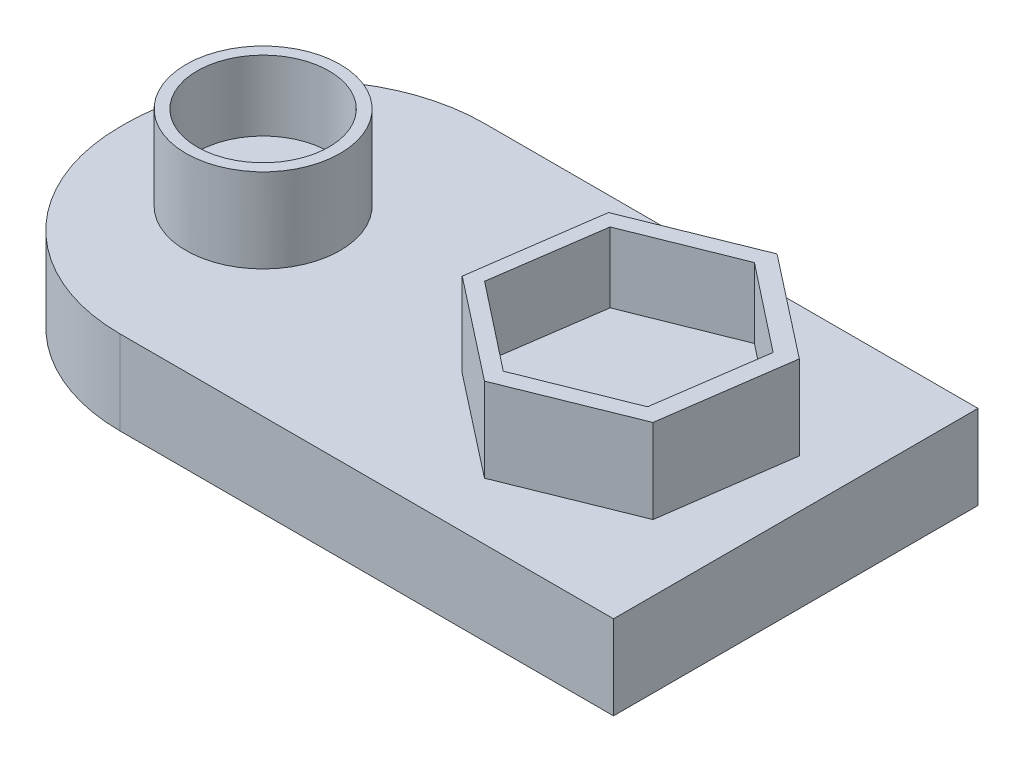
ISO-10303-21;
HEADER;
FILE_DESCRIPTION(('STEP AP214'),'2;1');
FILE_NAME('part.step','',(''),(''),'','','');
FILE_SCHEMA(('AUTOMOTIVE_DESIGN { 1 0 10303 214 1 1 1 1 }'));
ENDSEC;
DATA;
#1=APPLICATION_CONTEXT('core data for automotive mechanical design processes');
#2=APPLICATION_PROTOCOL_DEFINITION('international standard','automotive_design',2000,#1);
#3=PRODUCT_CONTEXT('',#1,'mechanical');
#4=PRODUCT('Part','Part','',(#3));
#5=PRODUCT_RELATED_PRODUCT_CATEGORY('part','',(#4));
#6=PRODUCT_DEFINITION_FORMATION('','',#4);
#7=PRODUCT_DEFINITION_CONTEXT('part definition',#1,'design');
#8=PRODUCT_DEFINITION('design','',#6,#7);
#9=PRODUCT_DEFINITION_SHAPE('','',#8);
#10=(LENGTH_UNIT() NAMED_UNIT(*) SI_UNIT(.MILLI.,.METRE.));
#11=(NAMED_UNIT(*) PLANE_ANGLE_UNIT() SI_UNIT($,.RADIAN.));
#12=(NAMED_UNIT(*) SI_UNIT($,.STERADIAN.) SOLID_ANGLE_UNIT());
#13=UNCERTAINTY_MEASURE_WITH_UNIT(LENGTH_MEASURE(1.E-05),#10,'distance_accuracy_value','');
#14=(GEOMETRIC_REPRESENTATION_CONTEXT(3) GLOBAL_UNCERTAINTY_ASSIGNED_CONTEXT((#13)) GLOBAL_UNIT_ASSIGNED_CONTEXT((#10,
#11,#12)) REPRESENTATION_CONTEXT('',''));
#15=CARTESIAN_POINT('',(0.,0.,0.));
#16=DIRECTION('',(0.,0.,1.));
#17=DIRECTION('',(1.,0.,0.));
#18=AXIS2_PLACEMENT_3D('',#15,#16,#17);
#19=CARTESIAN_POINT('',(6.4,3.,6.6));
#20=DIRECTION('',(0.,-1.,0.));
#21=DIRECTION('',(0.,0.,-1.));
#22=AXIS2_PLACEMENT_3D('',#19,#20,#21);
#23=PLANE('',#22);
#24=CARTESIAN_POINT('',(5.,3.,6.5));
#25=DIRECTION('',(0.,-1.,0.));
#26=DIRECTION('',(0.,0.,-1.));
#27=AXIS2_PLACEMENT_3D('',#24,#25,#26);
#28=CIRCLE('',#27,2.75);
#29=CARTESIAN_POINT('',(5.,3.,3.75));
#30=VERTEX_POINT('',#29);
#31=EDGE_CURVE('E11',#30,#30,#28,.F.);
#32=ORIENTED_EDGE('',*,*,#31,.F.);
#33=EDGE_LOOP('',(#32));
#34=FACE_BOUND('',#33,.T.);
#35=DIRECTION('',(0.,0.,-1.));
#36=VECTOR('',#35,1.);
#37=CARTESIAN_POINT('',(24.,3.,0.));
#38=LINE('',#37,#36);
#39=CARTESIAN_POINT('',(24.,3.,13.));
#40=VERTEX_POINT('',#39);
#41=CARTESIAN_POINT('',(24.,3.,0.));
#42=VERTEX_POINT('',#41);
#43=EDGE_CURVE('E287',#40,#42,#38,.T.);
#44=ORIENTED_EDGE('',*,*,#43,.T.);
#45=DIRECTION('',(-1.,0.,0.));
#46=VECTOR('',#45,1.);
#47=CARTESIAN_POINT('',(6.4,3.,0.));
#48=LINE('',#47,#46);
#49=CARTESIAN_POINT('',(6.4,3.,0.));
#50=VERTEX_POINT('',#49);
#51=EDGE_CURVE('E290',#42,#50,#48,.T.);
#52=ORIENTED_EDGE('',*,*,#51,.T.);
#53=CARTESIAN_POINT('',(6.4,3.,6.4));
#54=DIRECTION('',(0.,1.,0.));
#55=DIRECTION('',(0.,0.,-1.));
#56=AXIS2_PLACEMENT_3D('',#53,#54,#55);
#57=CIRCLE('',#56,6.4);
#58=CARTESIAN_POINT('',(0.,3.,6.4));
#59=VERTEX_POINT('',#58);
#60=EDGE_CURVE('E292',#50,#59,#57,.T.);
#61=ORIENTED_EDGE('',*,*,#60,.T.);
#62=DIRECTION('',(0.,0.,1.));
#63=VECTOR('',#62,1.);
#64=CARTESIAN_POINT('',(0.,3.,6.4));
#65=LINE('',#64,#63);
#66=CARTESIAN_POINT('',(0.,3.,6.59999999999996));
#67=VERTEX_POINT('',#66);
#68=EDGE_CURVE('E294',#59,#67,#65,.T.);
#69=ORIENTED_EDGE('',*,*,#68,.T.);
#70=CARTESIAN_POINT('',(6.4,3.,6.6));
#71=DIRECTION('',(0.,1.,0.));
#72=DIRECTION('',(0.,0.,-1.));
#73=AXIS2_PLACEMENT_3D('',#70,#71,#72);
#74=CIRCLE('',#73,6.4);
#75=CARTESIAN_POINT('',(6.40000000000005,3.,13.));
#76=VERTEX_POINT('',#75);
#77=EDGE_CURVE('E296',#67,#76,#74,.T.);
#78=ORIENTED_EDGE('',*,*,#77,.T.);
#79=DIRECTION('',(1.,0.,0.));
#80=VECTOR('',#79,1.);
#81=CARTESIAN_POINT('',(6.40000000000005,3.,13.));
#82=LINE('',#81,#80);
#83=EDGE_CURVE('E298',#76,#40,#82,.T.);
#84=ORIENTED_EDGE('',*,*,#83,.T.);
#85=EDGE_LOOP('',(#44,#52,#61,#69,#78,#84));
#86=FACE_BOUND('',#85,.T.);
#87=DIRECTION('',(0.927343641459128,0.,-0.374210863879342));
#88=VECTOR('',#87,1.);
#89=CARTESIAN_POINT('',(17.3552350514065,3.,10.9591383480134));
#90=LINE('',#89,#88);
#91=CARTESIAN_POINT('',(17.3552350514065,3.,10.9591383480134));
#92=VERTEX_POINT('',#91);
#93=CARTESIAN_POINT('',(21.6384518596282,3.,9.23073240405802));
#94=VERTEX_POINT('',#93);
#95=EDGE_CURVE('E225',#92,#94,#90,.T.);
#96=ORIENTED_EDGE('',*,*,#95,.F.);
#97=DIRECTION('',(0.787747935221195,0.,0.615997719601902));
#98=VECTOR('',#97,1.);
#99=CARTESIAN_POINT('',(13.7167831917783,3.,8.11396675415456));
#100=LINE('',#99,#98);
#101=CARTESIAN_POINT('',(13.7167831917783,3.,8.11396675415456));
#102=VERTEX_POINT('',#101);
#103=EDGE_CURVE('E238',#102,#92,#100,.T.);
#104=ORIENTED_EDGE('',*,*,#103,.F.);
#105=DIRECTION('',(-0.139595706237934,0.,0.990208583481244));
#106=VECTOR('',#105,1.);
#107=CARTESIAN_POINT('',(14.3615481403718,3.,3.54038921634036));
#108=LINE('',#107,#106);
#109=CARTESIAN_POINT('',(14.3615481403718,3.,3.54038921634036));
#110=VERTEX_POINT('',#109);
#111=EDGE_CURVE('E235',#110,#102,#108,.T.);
#112=ORIENTED_EDGE('',*,*,#111,.F.);
#113=DIRECTION('',(-0.927343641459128,0.,0.374210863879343));
#114=VECTOR('',#113,1.);
#115=CARTESIAN_POINT('',(18.6447649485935,3.,1.811983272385));
#116=LINE('',#115,#114);
#117=CARTESIAN_POINT('',(18.6447649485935,3.,1.811983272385));
#118=VERTEX_POINT('',#117);
#119=EDGE_CURVE('E232',#118,#110,#116,.T.);
#120=ORIENTED_EDGE('',*,*,#119,.F.);
#121=DIRECTION('',(-0.787747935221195,0.,-0.615997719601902));
#122=VECTOR('',#121,1.);
#123=CARTESIAN_POINT('',(22.2832168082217,3.,4.65715486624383));
#124=LINE('',#123,#122);
#125=CARTESIAN_POINT('',(22.2832168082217,3.,4.65715486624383));
#126=VERTEX_POINT('',#125);
#127=EDGE_CURVE('E229',#126,#118,#124,.T.);
#128=ORIENTED_EDGE('',*,*,#127,.F.);
#129=DIRECTION('',(0.139595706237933,0.,-0.990208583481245));
#130=VECTOR('',#129,1.);
#131=CARTESIAN_POINT('',(21.6384518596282,3.,9.23073240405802));
#132=LINE('',#131,#130);
#133=EDGE_CURVE('E60',#94,#126,#132,.T.);
#134=ORIENTED_EDGE('',*,*,#133,.F.);
#135=EDGE_LOOP('',(#96,#104,#112,#120,#128,#134));
#136=FACE_BOUND('',#135,.T.);
#137=ADVANCED_FACE('F37',(#34,#86,#136),#23,.F.);
#138=CARTESIAN_POINT('',(24.,3.,0.));
#139=DIRECTION('',(-1.,0.,0.));
#140=DIRECTION('',(0.,0.,1.));
#141=AXIS2_PLACEMENT_3D('',#138,#139,#140);
#142=PLANE('',#141);
#143=DIRECTION('',(0.,0.,-1.));
#144=VECTOR('',#143,1.);
#145=CARTESIAN_POINT('',(24.,0.,0.));
#146=LINE('',#145,#144);
#147=CARTESIAN_POINT('',(24.,0.,13.));
#148=VERTEX_POINT('',#147);
#149=CARTESIAN_POINT('',(24.,0.,0.));
#150=VERTEX_POINT('',#149);
#151=EDGE_CURVE('E274',#148,#150,#146,.T.);
#152=ORIENTED_EDGE('',*,*,#151,.T.);
#153=DIRECTION('',(0.,-1.,0.));
#154=VECTOR('',#153,1.);
#155=CARTESIAN_POINT('',(24.,3.,0.));
#156=LINE('',#155,#154);
#157=EDGE_CURVE('E45',#42,#150,#156,.T.);
#158=ORIENTED_EDGE('',*,*,#157,.F.);
#159=ORIENTED_EDGE('',*,*,#43,.F.);
#160=DIRECTION('',(0.,-1.,0.));
#161=VECTOR('',#160,1.);
#162=CARTESIAN_POINT('',(24.,3.,13.));
#163=LINE('',#162,#161);
#164=EDGE_CURVE('E300',#40,#148,#163,.T.);
#165=ORIENTED_EDGE('',*,*,#164,.T.);
#166=EDGE_LOOP('',(#152,#158,#159,#165));
#167=FACE_BOUND('',#166,.T.);
#168=ADVANCED_FACE('F39',(#167),#142,.F.);
#169=CARTESIAN_POINT('',(6.4,3.,0.));
#170=DIRECTION('',(0.,0.,1.));
#171=DIRECTION('',(1.,0.,0.));
#172=AXIS2_PLACEMENT_3D('',#169,#170,#171);
#173=PLANE('',#172);
#174=DIRECTION('',(-1.,0.,0.));
#175=VECTOR('',#174,1.);
#176=CARTESIAN_POINT('',(6.4,0.,0.));
#177=LINE('',#176,#175);
#178=CARTESIAN_POINT('',(6.4,0.,0.));
#179=VERTEX_POINT('',#178);
#180=EDGE_CURVE('E277',#150,#179,#177,.T.);
#181=ORIENTED_EDGE('',*,*,#180,.T.);
#182=DIRECTION('',(0.,-1.,0.));
#183=VECTOR('',#182,1.);
#184=CARTESIAN_POINT('',(6.4,3.,0.));
#185=LINE('',#184,#183);
#186=EDGE_CURVE('E312',#50,#179,#185,.T.);
#187=ORIENTED_EDGE('',*,*,#186,.F.);
#188=ORIENTED_EDGE('',*,*,#51,.F.);
#189=ORIENTED_EDGE('',*,*,#157,.T.);
#190=EDGE_LOOP('',(#181,#187,#188,#189));
#191=FACE_BOUND('',#190,.T.);
#192=ADVANCED_FACE('F317',(#191),#173,.F.);
#193=CARTESIAN_POINT('',(6.4,3.,6.4));
#194=DIRECTION('',(0.,-1.,0.));
#195=DIRECTION('',(0.,0.,-1.));
#196=AXIS2_PLACEMENT_3D('',#193,#194,#195);
#197=CYLINDRICAL_SURFACE('',#196,6.4);
#198=CARTESIAN_POINT('',(6.4,0.,6.4));
#199=DIRECTION('',(0.,1.,0.));
#200=DIRECTION('',(0.,0.,-1.));
#201=AXIS2_PLACEMENT_3D('',#198,#199,#200);
#202=CIRCLE('',#201,6.4);
#203=CARTESIAN_POINT('',(0.,0.,6.4));
#204=VERTEX_POINT('',#203);
#205=EDGE_CURVE('E279',#179,#204,#202,.T.);
#206=ORIENTED_EDGE('',*,*,#205,.T.);
#207=DIRECTION('',(0.,-1.,0.));
#208=VECTOR('',#207,1.);
#209=CARTESIAN_POINT('',(0.,3.,6.4));
#210=LINE('',#209,#208);
#211=EDGE_CURVE('E309',#59,#204,#210,.T.);
#212=ORIENTED_EDGE('',*,*,#211,.F.);
#213=ORIENTED_EDGE('',*,*,#60,.F.);
#214=ORIENTED_EDGE('',*,*,#186,.T.);
#215=EDGE_LOOP('',(#206,#212,#213,#214));
#216=FACE_BOUND('',#215,.T.);
#217=ADVANCED_FACE('F331',(#216),#197,.T.);
#218=CARTESIAN_POINT('',(0.,3.,6.4));
#219=DIRECTION('',(1.,0.,0.));
#220=DIRECTION('',(0.,0.,-1.));
#221=AXIS2_PLACEMENT_3D('',#218,#219,#220);
#222=PLANE('',#221);
#223=DIRECTION('',(0.,0.,1.));
#224=VECTOR('',#223,1.);
#225=CARTESIAN_POINT('',(0.,0.,6.4));
#226=LINE('',#225,#224);
#227=CARTESIAN_POINT('',(0.,0.,6.59999999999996));
#228=VERTEX_POINT('',#227);
#229=EDGE_CURVE('E281',#204,#228,#226,.T.);
#230=ORIENTED_EDGE('',*,*,#229,.T.);
#231=DIRECTION('',(0.,-1.,0.));
#232=VECTOR('',#231,1.);
#233=CARTESIAN_POINT('',(0.,3.,6.59999999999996));
#234=LINE('',#233,#232);
#235=EDGE_CURVE('E306',#67,#228,#234,.T.);
#236=ORIENTED_EDGE('',*,*,#235,.F.);
#237=ORIENTED_EDGE('',*,*,#68,.F.);
#238=ORIENTED_EDGE('',*,*,#211,.T.);
#239=EDGE_LOOP('',(#230,#236,#237,#238));
#240=FACE_BOUND('',#239,.T.);
#241=ADVANCED_FACE('F335',(#240),#222,.F.);
#242=CARTESIAN_POINT('',(6.4,3.,6.6));
#243=DIRECTION('',(0.,-1.,0.));
#244=DIRECTION('',(0.,0.,-1.));
#245=AXIS2_PLACEMENT_3D('',#242,#243,#244);
#246=CYLINDRICAL_SURFACE('',#245,6.4);
#247=CARTESIAN_POINT('',(6.4,0.,6.6));
#248=DIRECTION('',(0.,1.,0.));
#249=DIRECTION('',(0.,0.,-1.));
#250=AXIS2_PLACEMENT_3D('',#247,#248,#249);
#251=CIRCLE('',#250,6.4);
#252=CARTESIAN_POINT('',(6.40000000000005,0.,13.));
#253=VERTEX_POINT('',#252);
#254=EDGE_CURVE('E283',#228,#253,#251,.T.);
#255=ORIENTED_EDGE('',*,*,#254,.T.);
#256=DIRECTION('',(0.,-1.,0.));
#257=VECTOR('',#256,1.);
#258=CARTESIAN_POINT('',(6.40000000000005,3.,13.));
#259=LINE('',#258,#257);
#260=EDGE_CURVE('E303',#76,#253,#259,.T.);
#261=ORIENTED_EDGE('',*,*,#260,.F.);
#262=ORIENTED_EDGE('',*,*,#77,.F.);
#263=ORIENTED_EDGE('',*,*,#235,.T.);
#264=EDGE_LOOP('',(#255,#261,#262,#263));
#265=FACE_BOUND('',#264,.T.);
#266=ADVANCED_FACE('F344',(#265),#246,.T.);
#267=CARTESIAN_POINT('',(6.40000000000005,3.,13.));
#268=DIRECTION('',(0.,0.,-1.));
#269=DIRECTION('',(-1.,0.,0.));
#270=AXIS2_PLACEMENT_3D('',#267,#268,#269);
#271=PLANE('',#270);
#272=DIRECTION('',(1.,0.,0.));
#273=VECTOR('',#272,1.);
#274=CARTESIAN_POINT('',(6.40000000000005,0.,13.));
#275=LINE('',#274,#273);
#276=EDGE_CURVE('E285',#253,#148,#275,.T.);
#277=ORIENTED_EDGE('',*,*,#276,.T.);
#278=ORIENTED_EDGE('',*,*,#164,.F.);
#279=ORIENTED_EDGE('',*,*,#83,.F.);
#280=ORIENTED_EDGE('',*,*,#260,.T.);
#281=EDGE_LOOP('',(#277,#278,#279,#280));
#282=FACE_BOUND('',#281,.T.);
#283=ADVANCED_FACE('F342',(#282),#271,.F.);
#284=CARTESIAN_POINT('',(6.4,0.,6.6));
#285=DIRECTION('',(0.,-1.,0.));
#286=DIRECTION('',(0.,0.,-1.));
#287=AXIS2_PLACEMENT_3D('',#284,#285,#286);
#288=PLANE('',#287);
#289=ORIENTED_EDGE('',*,*,#151,.F.);
#290=ORIENTED_EDGE('',*,*,#276,.F.);
#291=ORIENTED_EDGE('',*,*,#254,.F.);
#292=ORIENTED_EDGE('',*,*,#229,.F.);
#293=ORIENTED_EDGE('',*,*,#205,.F.);
#294=ORIENTED_EDGE('',*,*,#180,.F.);
#295=EDGE_LOOP('',(#289,#290,#291,#292,#293,#294));
#296=FACE_BOUND('',#295,.T.);
#297=ADVANCED_FACE('F325',(#296),#288,.T.);
#298=CARTESIAN_POINT('',(5.,6.,6.5));
#299=DIRECTION('',(0.,-1.,0.));
#300=DIRECTION('',(0.,0.,-1.));
#301=AXIS2_PLACEMENT_3D('',#298,#299,#300);
#302=CYLINDRICAL_SURFACE('',#301,2.75);
#303=CARTESIAN_POINT('',(5.,6.,6.5));
#304=DIRECTION('',(0.,1.,0.));
#305=DIRECTION('',(0.,0.,1.));
#306=AXIS2_PLACEMENT_3D('',#303,#304,#305);
#307=CIRCLE('',#306,2.75);
#308=CARTESIAN_POINT('',(5.,6.,9.25));
#309=VERTEX_POINT('',#308);
#310=EDGE_CURVE('E271',#309,#309,#307,.T.);
#311=ORIENTED_EDGE('',*,*,#310,.F.);
#312=EDGE_LOOP('',(#311));
#313=FACE_BOUND('',#312,.T.);
#314=ORIENTED_EDGE('',*,*,#31,.T.);
#315=EDGE_LOOP('',(#314));
#316=FACE_BOUND('',#315,.T.);
#317=ADVANCED_FACE('F363',(#313,#316),#302,.T.);
#318=CARTESIAN_POINT('',(5.,6.,6.5));
#319=DIRECTION('',(0.,1.,0.));
#320=DIRECTION('',(0.,0.,1.));
#321=AXIS2_PLACEMENT_3D('',#318,#319,#320);
#322=PLANE('',#321);
#323=CARTESIAN_POINT('',(5.,6.,6.5));
#324=DIRECTION('',(0.,1.,0.));
#325=DIRECTION('',(0.,0.,1.));
#326=AXIS2_PLACEMENT_3D('',#323,#324,#325);
#327=CIRCLE('',#326,2.3523091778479);
#328=CARTESIAN_POINT('',(5.,6.,8.8523091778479));
#329=VERTEX_POINT('',#328);
#330=EDGE_CURVE('E213',#329,#329,#327,.T.);
#331=ORIENTED_EDGE('',*,*,#330,.F.);
#332=EDGE_LOOP('',(#331));
#333=FACE_BOUND('',#332,.T.);
#334=ORIENTED_EDGE('',*,*,#310,.T.);
#335=EDGE_LOOP('',(#334));
#336=FACE_BOUND('',#335,.T.);
#337=ADVANCED_FACE('F366',(#333,#336),#322,.T.);
#338=CARTESIAN_POINT('',(17.3552350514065,6.,10.9591383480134));
#339=DIRECTION('',(-0.374210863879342,0.,-0.927343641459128));
#340=DIRECTION('',(-0.927343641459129,0.,0.374210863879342));
#341=AXIS2_PLACEMENT_3D('',#338,#339,#340);
#342=PLANE('',#341);
#343=ORIENTED_EDGE('',*,*,#95,.T.);
#344=DIRECTION('',(0.,-1.,0.));
#345=VECTOR('',#344,1.);
#346=CARTESIAN_POINT('',(21.6384518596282,6.,9.23073240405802));
#347=LINE('',#346,#345);
#348=CARTESIAN_POINT('',(21.6384518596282,6.,9.23073240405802));
#349=VERTEX_POINT('',#348);
#350=EDGE_CURVE('E269',#349,#94,#347,.T.);
#351=ORIENTED_EDGE('',*,*,#350,.F.);
#352=DIRECTION('',(0.927343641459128,0.,-0.374210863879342));
#353=VECTOR('',#352,1.);
#354=CARTESIAN_POINT('',(17.3552350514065,6.,10.9591383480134));
#355=LINE('',#354,#353);
#356=CARTESIAN_POINT('',(17.3552350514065,6.,10.9591383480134));
#357=VERTEX_POINT('',#356);
#358=EDGE_CURVE('E241',#357,#349,#355,.T.);
#359=ORIENTED_EDGE('',*,*,#358,.F.);
#360=DIRECTION('',(0.,-1.,0.));
#361=VECTOR('',#360,1.);
#362=CARTESIAN_POINT('',(17.3552350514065,6.,10.9591383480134));
#363=LINE('',#362,#361);
#364=EDGE_CURVE('E254',#357,#92,#363,.T.);
#365=ORIENTED_EDGE('',*,*,#364,.T.);
#366=EDGE_LOOP('',(#343,#351,#359,#365));
#367=FACE_BOUND('',#366,.T.);
#368=ADVANCED_FACE('F370',(#367),#342,.F.);
#369=CARTESIAN_POINT('',(21.6384518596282,6.,9.23073240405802));
#370=DIRECTION('',(-0.990208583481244,0.,-0.139595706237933));
#371=DIRECTION('',(-0.139595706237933,0.,0.990208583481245));
#372=AXIS2_PLACEMENT_3D('',#369,#370,#371);
#373=PLANE('',#372);
#374=ORIENTED_EDGE('',*,*,#133,.T.);
#375=DIRECTION('',(0.,-1.,0.));
#376=VECTOR('',#375,1.);
#377=CARTESIAN_POINT('',(22.2832168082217,6.,4.65715486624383));
#378=LINE('',#377,#376);
#379=CARTESIAN_POINT('',(22.2832168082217,6.,4.65715486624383));
#380=VERTEX_POINT('',#379);
#381=EDGE_CURVE('E266',#380,#126,#378,.T.);
#382=ORIENTED_EDGE('',*,*,#381,.F.);
#383=DIRECTION('',(0.139595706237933,0.,-0.990208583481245));
#384=VECTOR('',#383,1.);
#385=CARTESIAN_POINT('',(21.6384518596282,6.,9.23073240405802));
#386=LINE('',#385,#384);
#387=EDGE_CURVE('E244',#349,#380,#386,.T.);
#388=ORIENTED_EDGE('',*,*,#387,.F.);
#389=ORIENTED_EDGE('',*,*,#350,.T.);
#390=EDGE_LOOP('',(#374,#382,#388,#389));
#391=FACE_BOUND('',#390,.T.);
#392=ADVANCED_FACE('F374',(#391),#373,.F.);
#393=CARTESIAN_POINT('',(22.2832168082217,6.,4.65715486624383));
#394=DIRECTION('',(-0.615997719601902,0.,0.787747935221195));
#395=DIRECTION('',(0.787747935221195,0.,0.615997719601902));
#396=AXIS2_PLACEMENT_3D('',#393,#394,#395);
#397=PLANE('',#396);
#398=ORIENTED_EDGE('',*,*,#127,.T.);
#399=DIRECTION('',(0.,-1.,0.));
#400=VECTOR('',#399,1.);
#401=CARTESIAN_POINT('',(18.6447649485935,6.,1.811983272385));
#402=LINE('',#401,#400);
#403=CARTESIAN_POINT('',(18.6447649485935,6.,1.811983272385));
#404=VERTEX_POINT('',#403);
#405=EDGE_CURVE('E263',#404,#118,#402,.T.);
#406=ORIENTED_EDGE('',*,*,#405,.F.);
#407=DIRECTION('',(-0.787747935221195,0.,-0.615997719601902));
#408=VECTOR('',#407,1.);
#409=CARTESIAN_POINT('',(22.2832168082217,6.,4.65715486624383));
#410=LINE('',#409,#408);
#411=EDGE_CURVE('E246',#380,#404,#410,.T.);
#412=ORIENTED_EDGE('',*,*,#411,.F.);
#413=ORIENTED_EDGE('',*,*,#381,.T.);
#414=EDGE_LOOP('',(#398,#406,#412,#413));
#415=FACE_BOUND('',#414,.T.);
#416=ADVANCED_FACE('F378',(#415),#397,.F.);
#417=CARTESIAN_POINT('',(18.6447649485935,6.,1.811983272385));
#418=DIRECTION('',(0.374210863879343,0.,0.927343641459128));
#419=DIRECTION('',(0.927343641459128,0.,-0.374210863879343));
#420=AXIS2_PLACEMENT_3D('',#417,#418,#419);
#421=PLANE('',#420);
#422=ORIENTED_EDGE('',*,*,#119,.T.);
#423=DIRECTION('',(0.,-1.,0.));
#424=VECTOR('',#423,1.);
#425=CARTESIAN_POINT('',(14.3615481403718,6.,3.54038921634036));
#426=LINE('',#425,#424);
#427=CARTESIAN_POINT('',(14.3615481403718,6.,3.54038921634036));
#428=VERTEX_POINT('',#427);
#429=EDGE_CURVE('E260',#428,#110,#426,.T.);
#430=ORIENTED_EDGE('',*,*,#429,.F.);
#431=DIRECTION('',(-0.927343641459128,0.,0.374210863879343));
#432=VECTOR('',#431,1.);
#433=CARTESIAN_POINT('',(18.6447649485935,6.,1.811983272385));
#434=LINE('',#433,#432);
#435=EDGE_CURVE('E248',#404,#428,#434,.T.);
#436=ORIENTED_EDGE('',*,*,#435,.F.);
#437=ORIENTED_EDGE('',*,*,#405,.T.);
#438=EDGE_LOOP('',(#422,#430,#436,#437));
#439=FACE_BOUND('',#438,.T.);
#440=ADVANCED_FACE('F382',(#439),#421,.F.);
#441=CARTESIAN_POINT('',(14.3615481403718,6.,3.54038921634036));
#442=DIRECTION('',(0.990208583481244,0.,0.139595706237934));
#443=DIRECTION('',(0.139595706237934,0.,-0.990208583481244));
#444=AXIS2_PLACEMENT_3D('',#441,#442,#443);
#445=PLANE('',#444);
#446=ORIENTED_EDGE('',*,*,#111,.T.);
#447=DIRECTION('',(0.,-1.,0.));
#448=VECTOR('',#447,1.);
#449=CARTESIAN_POINT('',(13.7167831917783,6.,8.11396675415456));
#450=LINE('',#449,#448);
#451=CARTESIAN_POINT('',(13.7167831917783,6.,8.11396675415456));
#452=VERTEX_POINT('',#451);
#453=EDGE_CURVE('E257',#452,#102,#450,.T.);
#454=ORIENTED_EDGE('',*,*,#453,.F.);
#455=DIRECTION('',(-0.139595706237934,0.,0.990208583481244));
#456=VECTOR('',#455,1.);
#457=CARTESIAN_POINT('',(14.3615481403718,6.,3.54038921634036));
#458=LINE('',#457,#456);
#459=EDGE_CURVE('E250',#428,#452,#458,.T.);
#460=ORIENTED_EDGE('',*,*,#459,.F.);
#461=ORIENTED_EDGE('',*,*,#429,.T.);
#462=EDGE_LOOP('',(#446,#454,#460,#461));
#463=FACE_BOUND('',#462,.T.);
#464=ADVANCED_FACE('F386',(#463),#445,.F.);
#465=CARTESIAN_POINT('',(13.7167831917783,6.,8.11396675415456));
#466=DIRECTION('',(0.615997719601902,0.,-0.787747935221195));
#467=DIRECTION('',(-0.787747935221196,0.,-0.615997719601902));
#468=AXIS2_PLACEMENT_3D('',#465,#466,#467);
#469=PLANE('',#468);
#470=ORIENTED_EDGE('',*,*,#103,.T.);
#471=ORIENTED_EDGE('',*,*,#364,.F.);
#472=DIRECTION('',(0.787747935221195,0.,0.615997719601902));
#473=VECTOR('',#472,1.);
#474=CARTESIAN_POINT('',(13.7167831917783,6.,8.11396675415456));
#475=LINE('',#474,#473);
#476=EDGE_CURVE('E252',#452,#357,#475,.T.);
#477=ORIENTED_EDGE('',*,*,#476,.F.);
#478=ORIENTED_EDGE('',*,*,#453,.T.);
#479=EDGE_LOOP('',(#470,#471,#477,#478));
#480=FACE_BOUND('',#479,.T.);
#481=ADVANCED_FACE('F390',(#480),#469,.F.);
#482=CARTESIAN_POINT('',(21.6384518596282,6.,9.23073240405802));
#483=DIRECTION('',(0.,1.,0.));
#484=DIRECTION('',(0.,0.,1.));
#485=AXIS2_PLACEMENT_3D('',#482,#483,#484);
#486=PLANE('',#485);
#487=DIRECTION('',(0.92821620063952,0.,-0.372041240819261));
#488=VECTOR('',#487,1.);
#489=CARTESIAN_POINT('',(17.3843760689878,6.,10.3169348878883));
#490=LINE('',#489,#488);
#491=CARTESIAN_POINT('',(17.3843760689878,6.,10.3169348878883));
#492=VERTEX_POINT('',#491);
#493=CARTESIAN_POINT('',(21.0573106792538,6.,8.84477446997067));
#494=VERTEX_POINT('',#493);
#495=EDGE_CURVE('E52',#492,#494,#490,.T.);
#496=ORIENTED_EDGE('',*,*,#495,.F.);
#497=DIRECTION('',(0.786305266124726,0.,0.617838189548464));
#498=VECTOR('',#497,1.);
#499=CARTESIAN_POINT('',(14.2729804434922,6.,7.87216041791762));
#500=LINE('',#499,#498);
#501=CARTESIAN_POINT('',(14.2729804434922,6.,7.87216041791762));
#502=VERTEX_POINT('',#501);
#503=EDGE_CURVE('E193',#502,#492,#500,.T.);
#504=ORIENTED_EDGE('',*,*,#503,.F.);
#505=DIRECTION('',(-0.141910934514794,0.,0.989879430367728));
#506=VECTOR('',#505,1.);
#507=CARTESIAN_POINT('',(14.8345194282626,6.,3.95522553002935));
#508=LINE('',#507,#506);
#509=CARTESIAN_POINT('',(14.8345194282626,6.,3.95522553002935));
#510=VERTEX_POINT('',#509);
#511=EDGE_CURVE('E187',#510,#502,#508,.T.);
#512=ORIENTED_EDGE('',*,*,#511,.F.);
#513=DIRECTION('',(-0.92821620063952,0.,0.37204124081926));
#514=VECTOR('',#513,1.);
#515=CARTESIAN_POINT('',(18.5074540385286,6.,2.48306511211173));
#516=LINE('',#515,#514);
#517=CARTESIAN_POINT('',(18.5074540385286,6.,2.48306511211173));
#518=VERTEX_POINT('',#517);
#519=EDGE_CURVE('E185',#518,#510,#516,.T.);
#520=ORIENTED_EDGE('',*,*,#519,.F.);
#521=DIRECTION('',(-0.786305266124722,0.,-0.617838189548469));
#522=VECTOR('',#521,1.);
#523=CARTESIAN_POINT('',(21.6188496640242,6.,4.9278395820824));
#524=LINE('',#523,#522);
#525=CARTESIAN_POINT('',(21.6188496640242,6.,4.9278395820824));
#526=VERTEX_POINT('',#525);
#527=EDGE_CURVE('E166',#526,#518,#524,.T.);
#528=ORIENTED_EDGE('',*,*,#527,.F.);
#529=DIRECTION('',(0.141910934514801,0.,-0.989879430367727));
#530=VECTOR('',#529,1.);
#531=CARTESIAN_POINT('',(21.0573106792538,6.,8.84477446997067));
#532=LINE('',#531,#530);
#533=EDGE_CURVE('E177',#494,#526,#532,.T.);
#534=ORIENTED_EDGE('',*,*,#533,.F.);
#535=EDGE_LOOP('',(#496,#504,#512,#520,#528,#534));
#536=FACE_BOUND('',#535,.T.);
#537=ORIENTED_EDGE('',*,*,#358,.T.);
#538=ORIENTED_EDGE('',*,*,#387,.T.);
#539=ORIENTED_EDGE('',*,*,#411,.T.);
#540=ORIENTED_EDGE('',*,*,#435,.T.);
#541=ORIENTED_EDGE('',*,*,#459,.T.);
#542=ORIENTED_EDGE('',*,*,#476,.T.);
#543=EDGE_LOOP('',(#537,#538,#539,#540,#541,#542));
#544=FACE_BOUND('',#543,.T.);
#545=ADVANCED_FACE('F181',(#536,#544),#486,.T.);
#546=CARTESIAN_POINT('',(5.,3.5,6.5));
#547=DIRECTION('',(0.,1.,0.));
#548=DIRECTION('',(0.,0.,1.));
#549=AXIS2_PLACEMENT_3D('',#546,#547,#548);
#550=CYLINDRICAL_SURFACE('',#549,2.3523091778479);
#551=CARTESIAN_POINT('',(5.,3.5,6.5));
#552=DIRECTION('',(0.,1.,0.));
#553=DIRECTION('',(0.,0.,1.));
#554=AXIS2_PLACEMENT_3D('',#551,#552,#553);
#555=CIRCLE('',#554,2.3523091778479);
#556=CARTESIAN_POINT('',(5.,3.5,8.8523091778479));
#557=VERTEX_POINT('',#556);
#558=EDGE_CURVE('E222',#557,#557,#555,.T.);
#559=ORIENTED_EDGE('',*,*,#558,.F.);
#560=EDGE_LOOP('',(#559));
#561=FACE_BOUND('',#560,.T.);
#562=ORIENTED_EDGE('',*,*,#330,.T.);
#563=EDGE_LOOP('',(#562));
#564=FACE_BOUND('',#563,.T.);
#565=ADVANCED_FACE('F397',(#561,#564),#550,.F.);
#566=CARTESIAN_POINT('',(5.,3.5,6.5));
#567=DIRECTION('',(0.,1.,0.));
#568=DIRECTION('',(0.,0.,1.));
#569=AXIS2_PLACEMENT_3D('',#566,#567,#568);
#570=PLANE('',#569);
#571=ORIENTED_EDGE('',*,*,#558,.T.);
#572=EDGE_LOOP('',(#571));
#573=FACE_BOUND('',#572,.T.);
#574=ADVANCED_FACE('F400',(#573),#570,.T.);
#575=CARTESIAN_POINT('',(17.3843760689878,3.5,10.3169348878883));
#576=DIRECTION('',(0.372041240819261,0.,0.92821620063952));
#577=DIRECTION('',(0.92821620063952,0.,-0.372041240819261));
#578=AXIS2_PLACEMENT_3D('',#575,#576,#577);
#579=PLANE('',#578);
#580=ORIENTED_EDGE('',*,*,#495,.T.);
#581=DIRECTION('',(0.,1.,0.));
#582=VECTOR('',#581,1.);
#583=CARTESIAN_POINT('',(21.0573106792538,3.5,8.84477446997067));
#584=LINE('',#583,#582);
#585=CARTESIAN_POINT('',(21.0573106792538,3.5,8.84477446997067));
#586=VERTEX_POINT('',#585);
#587=EDGE_CURVE('E174',#586,#494,#584,.T.);
#588=ORIENTED_EDGE('',*,*,#587,.F.);
#589=DIRECTION('',(0.92821620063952,0.,-0.372041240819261));
#590=VECTOR('',#589,1.);
#591=CARTESIAN_POINT('',(17.3843760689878,3.5,10.3169348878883));
#592=LINE('',#591,#590);
#593=CARTESIAN_POINT('',(17.3843760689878,3.5,10.3169348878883));
#594=VERTEX_POINT('',#593);
#595=EDGE_CURVE('E196',#594,#586,#592,.T.);
#596=ORIENTED_EDGE('',*,*,#595,.F.);
#597=DIRECTION('',(0.,1.,0.));
#598=VECTOR('',#597,1.);
#599=CARTESIAN_POINT('',(17.3843760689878,3.5,10.3169348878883));
#600=LINE('',#599,#598);
#601=EDGE_CURVE('E211',#594,#492,#600,.T.);
#602=ORIENTED_EDGE('',*,*,#601,.T.);
#603=EDGE_LOOP('',(#580,#588,#596,#602));
#604=FACE_BOUND('',#603,.T.);
#605=ADVANCED_FACE('F404',(#604),#579,.F.);
#606=CARTESIAN_POINT('',(14.2729804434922,3.5,7.87216041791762));
#607=DIRECTION('',(-0.617838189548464,0.,0.786305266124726));
#608=DIRECTION('',(0.786305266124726,0.,0.617838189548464));
#609=AXIS2_PLACEMENT_3D('',#606,#607,#608);
#610=PLANE('',#609);
#611=ORIENTED_EDGE('',*,*,#503,.T.);
#612=ORIENTED_EDGE('',*,*,#601,.F.);
#613=DIRECTION('',(0.786305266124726,0.,0.617838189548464));
#614=VECTOR('',#613,1.);
#615=CARTESIAN_POINT('',(14.2729804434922,3.5,7.87216041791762));
#616=LINE('',#615,#614);
#617=CARTESIAN_POINT('',(14.2729804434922,3.5,7.87216041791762));
#618=VERTEX_POINT('',#617);
#619=EDGE_CURVE('E208',#618,#594,#616,.T.);
#620=ORIENTED_EDGE('',*,*,#619,.F.);
#621=DIRECTION('',(0.,1.,0.));
#622=VECTOR('',#621,1.);
#623=CARTESIAN_POINT('',(14.2729804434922,3.5,7.87216041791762));
#624=LINE('',#623,#622);
#625=EDGE_CURVE('E214',#618,#502,#624,.T.);
#626=ORIENTED_EDGE('',*,*,#625,.T.);
#627=EDGE_LOOP('',(#611,#612,#620,#626));
#628=FACE_BOUND('',#627,.T.);
#629=ADVANCED_FACE('F408',(#628),#610,.F.);
#630=CARTESIAN_POINT('',(14.8345194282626,3.5,3.95522553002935));
#631=DIRECTION('',(-0.989879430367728,0.,-0.141910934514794));
#632=DIRECTION('',(-0.141910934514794,0.,0.989879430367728));
#633=AXIS2_PLACEMENT_3D('',#630,#631,#632);
#634=PLANE('',#633);
#635=ORIENTED_EDGE('',*,*,#511,.T.);
#636=ORIENTED_EDGE('',*,*,#625,.F.);
#637=DIRECTION('',(-0.141910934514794,0.,0.989879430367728));
#638=VECTOR('',#637,1.);
#639=CARTESIAN_POINT('',(14.8345194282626,3.5,3.95522553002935));
#640=LINE('',#639,#638);
#641=CARTESIAN_POINT('',(14.8345194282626,3.5,3.95522553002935));
#642=VERTEX_POINT('',#641);
#643=EDGE_CURVE('E205',#642,#618,#640,.T.);
#644=ORIENTED_EDGE('',*,*,#643,.F.);
#645=DIRECTION('',(0.,1.,0.));
#646=VECTOR('',#645,1.);
#647=CARTESIAN_POINT('',(14.8345194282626,3.5,3.95522553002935));
#648=LINE('',#647,#646);
#649=EDGE_CURVE('E216',#642,#510,#648,.T.);
#650=ORIENTED_EDGE('',*,*,#649,.T.);
#651=EDGE_LOOP('',(#635,#636,#644,#650));
#652=FACE_BOUND('',#651,.T.);
#653=ADVANCED_FACE('F417',(#652),#634,.F.);
#654=CARTESIAN_POINT('',(18.5074540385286,3.5,2.48306511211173));
#655=DIRECTION('',(-0.37204124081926,0.,-0.92821620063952));
#656=DIRECTION('',(-0.92821620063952,0.,0.37204124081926));
#657=AXIS2_PLACEMENT_3D('',#654,#655,#656);
#658=PLANE('',#657);
#659=ORIENTED_EDGE('',*,*,#519,.T.);
#660=ORIENTED_EDGE('',*,*,#649,.F.);
#661=DIRECTION('',(-0.92821620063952,0.,0.37204124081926));
#662=VECTOR('',#661,1.);
#663=CARTESIAN_POINT('',(18.5074540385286,3.5,2.48306511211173));
#664=LINE('',#663,#662);
#665=CARTESIAN_POINT('',(18.5074540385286,3.5,2.48306511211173));
#666=VERTEX_POINT('',#665);
#667=EDGE_CURVE('E202',#666,#642,#664,.T.);
#668=ORIENTED_EDGE('',*,*,#667,.F.);
#669=DIRECTION('',(0.,1.,0.));
#670=VECTOR('',#669,1.);
#671=CARTESIAN_POINT('',(18.5074540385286,3.5,2.48306511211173));
#672=LINE('',#671,#670);
#673=EDGE_CURVE('E173',#666,#518,#672,.T.);
#674=ORIENTED_EDGE('',*,*,#673,.T.);
#675=EDGE_LOOP('',(#659,#660,#668,#674));
#676=FACE_BOUND('',#675,.T.);
#677=ADVANCED_FACE('F414',(#676),#658,.F.);
#678=CARTESIAN_POINT('',(21.6188496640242,3.5,4.9278395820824));
#679=DIRECTION('',(0.617838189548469,0.,-0.786305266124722));
#680=DIRECTION('',(-0.786305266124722,0.,-0.617838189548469));
#681=AXIS2_PLACEMENT_3D('',#678,#679,#680);
#682=PLANE('',#681);
#683=ORIENTED_EDGE('',*,*,#527,.T.);
#684=ORIENTED_EDGE('',*,*,#673,.F.);
#685=DIRECTION('',(-0.786305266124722,0.,-0.617838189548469));
#686=VECTOR('',#685,1.);
#687=CARTESIAN_POINT('',(21.6188496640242,3.5,4.9278395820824));
#688=LINE('',#687,#686);
#689=CARTESIAN_POINT('',(21.6188496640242,3.5,4.9278395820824));
#690=VERTEX_POINT('',#689);
#691=EDGE_CURVE('E169',#690,#666,#688,.T.);
#692=ORIENTED_EDGE('',*,*,#691,.F.);
#693=DIRECTION('',(0.,1.,0.));
#694=VECTOR('',#693,1.);
#695=CARTESIAN_POINT('',(21.6188496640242,3.5,4.9278395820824));
#696=LINE('',#695,#694);
#697=EDGE_CURVE('E162',#690,#526,#696,.T.);
#698=ORIENTED_EDGE('',*,*,#697,.T.);
#699=EDGE_LOOP('',(#683,#684,#692,#698));
#700=FACE_BOUND('',#699,.T.);
#701=ADVANCED_FACE('F164',(#700),#682,.F.);
#702=CARTESIAN_POINT('',(21.0573106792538,3.5,8.84477446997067));
#703=DIRECTION('',(0.989879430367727,0.,0.141910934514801));
#704=DIRECTION('',(0.141910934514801,0.,-0.989879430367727));
#705=AXIS2_PLACEMENT_3D('',#702,#703,#704);
#706=PLANE('',#705);
#707=ORIENTED_EDGE('',*,*,#533,.T.);
#708=ORIENTED_EDGE('',*,*,#697,.F.);
#709=DIRECTION('',(0.141910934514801,0.,-0.989879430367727));
#710=VECTOR('',#709,1.);
#711=CARTESIAN_POINT('',(21.0573106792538,3.5,8.84477446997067));
#712=LINE('',#711,#710);
#713=EDGE_CURVE('E199',#586,#690,#712,.T.);
#714=ORIENTED_EDGE('',*,*,#713,.F.);
#715=ORIENTED_EDGE('',*,*,#587,.T.);
#716=EDGE_LOOP('',(#707,#708,#714,#715));
#717=FACE_BOUND('',#716,.T.);
#718=ADVANCED_FACE('F178',(#717),#706,.F.);
#719=CARTESIAN_POINT('',(24.7302452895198,3.5,7.37261405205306));
#720=DIRECTION('',(0.,1.,0.));
#721=DIRECTION('',(0.,0.,1.));
#722=AXIS2_PLACEMENT_3D('',#719,#720,#721);
#723=PLANE('',#722);
#724=ORIENTED_EDGE('',*,*,#595,.T.);
#725=ORIENTED_EDGE('',*,*,#713,.T.);
#726=ORIENTED_EDGE('',*,*,#691,.T.);
#727=ORIENTED_EDGE('',*,*,#667,.T.);
#728=ORIENTED_EDGE('',*,*,#643,.T.);
#729=ORIENTED_EDGE('',*,*,#619,.T.);
#730=EDGE_LOOP('',(#724,#725,#726,#727,#728,#729));
#731=FACE_BOUND('',#730,.T.);
#732=ADVANCED_FACE('F411',(#731),#723,.T.);
#733=CLOSED_SHELL('',(#137,#168,#192,#217,#241,#266,#283,#297,#317,#337,#368,#392,#416,#440,
#464,#481,#545,#565,#574,#605,#629,#653,#677,#701,#718,#732));
#734=MANIFOLD_SOLID_BREP('B2',#733);
#735=ADVANCED_BREP_SHAPE_REPRESENTATION('',(#18,#734),#14);
#736=SHAPE_DEFINITION_REPRESENTATION(#9,#735);
ENDSEC;
END-ISO-10303-21;
